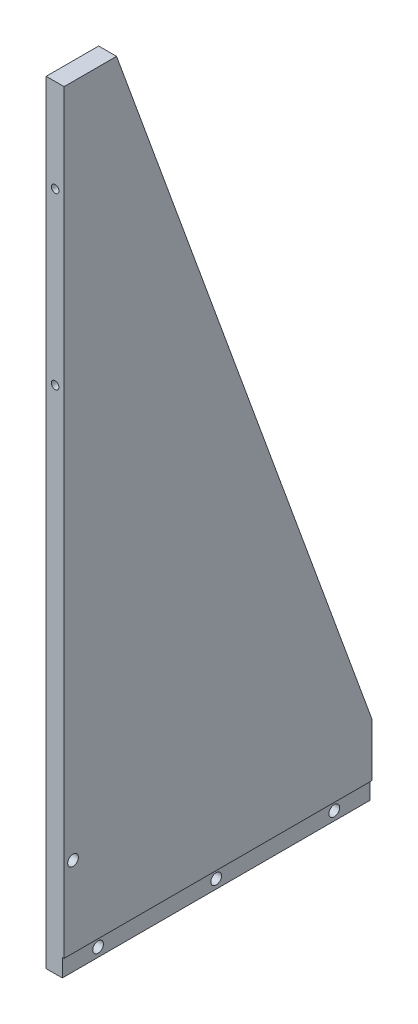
from build123d import *

# Parameters (mm, degrees)
BOSS_EXTRUDE1_DEPTH       = 6.35
F_6_32_TAPPED_HOLE1_D     = 2.7051
F_6_32_TAPPED_HOLE1_DEPTH = 10.9728
F_6_32_TAPPED_HOLE1_TIP   = 0.81269403
SKETCH4_W                 = 109.22
SKETCH4_H                 = 6.35
CUT_EXTRUDE1_DEPTH        = 0.635
F_6_CLEARANCE_HOLE1_D     = 3.7973


with BuildPart() as part:
    # Sketch1 → Boss-Extrude1 (new body)
    with BuildSketch(Plane(origin=(0, 0, 0), x_dir=(0, 0, -1), z_dir=(1, 0, 0))):
        Polygon((0, 274.32), (0, 0), (109.22, 0), (109.22, 25.4), (18.620529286, 274.32), align=None)
    extrude(amount=BOSS_EXTRUDE1_DEPTH)

    # 6-32 Tapped Hole1
    with Locations(Plane.XY):
        with Locations((3.175, 241.3), (3.175, 180.975)):
            Hole(F_6_32_TAPPED_HOLE1_D / 2, depth=F_6_32_TAPPED_HOLE1_DEPTH)
            with Locations((0, 0, -(F_6_32_TAPPED_HOLE1_DEPTH + F_6_32_TAPPED_HOLE1_TIP / 2))):  # 118° drill point
                Cone(0, F_6_32_TAPPED_HOLE1_D / 2, F_6_32_TAPPED_HOLE1_TIP, mode=Mode.SUBTRACT)

    # Sketch4 → Cut-Extrude1 (cut)
    with BuildSketch(Plane(origin=(6.35, 0, 0), x_dir=(0, 0, -1), z_dir=(1, 0, 0))):
        with Locations((54.61, 3.175)):
            Rectangle(SKETCH4_W, SKETCH4_H)
    extrude(amount=-CUT_EXTRUDE1_DEPTH, mode=Mode.SUBTRACT)

    # 6 Clearance Hole1 (through all)
    with Locations(Plane.ZY):
        with Locations((-96.52, 3.175), (-54.61, 3.175), (-12.7, 3.175), (-3.175, 34.925)):
            Hole(F_6_CLEARANCE_HOLE1_D / 2)


solid = part.part
